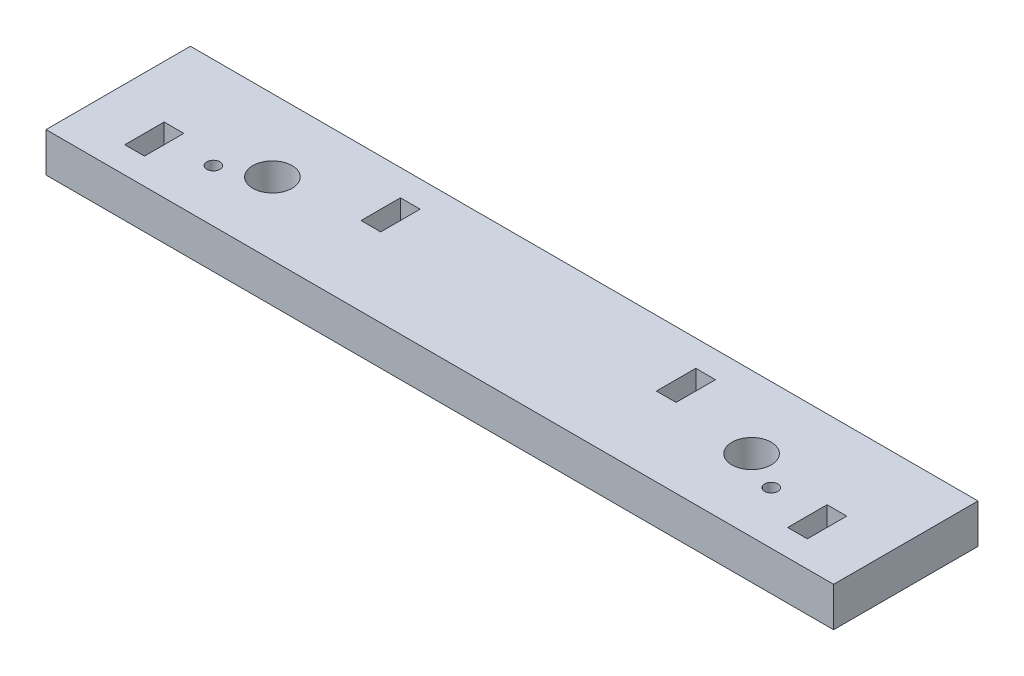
ISO-10303-21;
HEADER;
FILE_DESCRIPTION(('STEP AP214'),'2;1');
FILE_NAME('part.step','',(''),(''),'','','');
FILE_SCHEMA(('AUTOMOTIVE_DESIGN { 1 0 10303 214 1 1 1 1 }'));
ENDSEC;
DATA;
#1=APPLICATION_CONTEXT('core data for automotive mechanical design processes');
#2=APPLICATION_PROTOCOL_DEFINITION('international standard','automotive_design',2000,#1);
#3=PRODUCT_CONTEXT('',#1,'mechanical');
#4=PRODUCT('Part','Part','',(#3));
#5=PRODUCT_RELATED_PRODUCT_CATEGORY('part','',(#4));
#6=PRODUCT_DEFINITION_FORMATION('','',#4);
#7=PRODUCT_DEFINITION_CONTEXT('part definition',#1,'design');
#8=PRODUCT_DEFINITION('design','',#6,#7);
#9=PRODUCT_DEFINITION_SHAPE('','',#8);
#10=(LENGTH_UNIT() NAMED_UNIT(*) SI_UNIT(.MILLI.,.METRE.));
#11=(NAMED_UNIT(*) PLANE_ANGLE_UNIT() SI_UNIT($,.RADIAN.));
#12=(NAMED_UNIT(*) SI_UNIT($,.STERADIAN.) SOLID_ANGLE_UNIT());
#13=UNCERTAINTY_MEASURE_WITH_UNIT(LENGTH_MEASURE(1.E-05),#10,'distance_accuracy_value','');
#14=(GEOMETRIC_REPRESENTATION_CONTEXT(3) GLOBAL_UNCERTAINTY_ASSIGNED_CONTEXT((#13)) GLOBAL_UNIT_ASSIGNED_CONTEXT((#10,
#11,#12)) REPRESENTATION_CONTEXT('',''));
#15=CARTESIAN_POINT('',(0.,0.,0.));
#16=DIRECTION('',(0.,0.,1.));
#17=DIRECTION('',(1.,0.,0.));
#18=AXIS2_PLACEMENT_3D('',#15,#16,#17);
#19=CARTESIAN_POINT('',(-110.929014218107,19.05,-31.75));
#20=DIRECTION('',(0.,0.,1.));
#21=DIRECTION('',(1.,0.,0.));
#22=AXIS2_PLACEMENT_3D('',#19,#20,#21);
#23=PLANE('',#22);
#24=DIRECTION('',(-1.,0.,0.));
#25=VECTOR('',#24,1.);
#26=CARTESIAN_POINT('',(-110.929014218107,0.,-31.75));
#27=LINE('',#26,#25);
#28=CARTESIAN_POINT('',(355.6,0.,-31.75));
#29=VERTEX_POINT('',#28);
#30=CARTESIAN_POINT('',(346.075,0.,-31.75));
#31=VERTEX_POINT('',#30);
#32=EDGE_CURVE('E267',#29,#31,#27,.T.);
#33=ORIENTED_EDGE('',*,*,#32,.F.);
#34=DIRECTION('',(0.,-1.,0.));
#35=VECTOR('',#34,1.);
#36=CARTESIAN_POINT('',(355.6,19.05,-31.75));
#37=LINE('',#36,#35);
#38=CARTESIAN_POINT('',(355.6,19.05,-31.75));
#39=VERTEX_POINT('',#38);
#40=EDGE_CURVE('E11',#39,#29,#37,.T.);
#41=ORIENTED_EDGE('',*,*,#40,.F.);
#42=DIRECTION('',(-1.,0.,0.));
#43=VECTOR('',#42,1.);
#44=CARTESIAN_POINT('',(-110.929014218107,19.05,-31.75));
#45=LINE('',#44,#43);
#46=CARTESIAN_POINT('',(346.075,19.05,-31.75));
#47=VERTEX_POINT('',#46);
#48=EDGE_CURVE('E199',#39,#47,#45,.T.);
#49=ORIENTED_EDGE('',*,*,#48,.T.);
#50=DIRECTION('',(0.,-1.,0.));
#51=VECTOR('',#50,1.);
#52=CARTESIAN_POINT('',(346.075,19.05,-31.75));
#53=LINE('',#52,#51);
#54=EDGE_CURVE('E125',#47,#31,#53,.T.);
#55=ORIENTED_EDGE('',*,*,#54,.T.);
#56=EDGE_LOOP('',(#33,#41,#49,#55));
#57=FACE_BOUND('',#56,.T.);
#58=ADVANCED_FACE('F35',(#57),#23,.T.);
#59=CARTESIAN_POINT('',(355.6,19.05,-34.925));
#60=DIRECTION('',(-1.,0.,0.));
#61=DIRECTION('',(0.,0.,1.));
#62=AXIS2_PLACEMENT_3D('',#59,#60,#61);
#63=PLANE('',#62);
#64=DIRECTION('',(0.,0.,-1.));
#65=VECTOR('',#64,1.);
#66=CARTESIAN_POINT('',(355.6,0.,-34.925));
#67=LINE('',#66,#65);
#68=CARTESIAN_POINT('',(355.6,0.,-12.7));
#69=VERTEX_POINT('',#68);
#70=EDGE_CURVE('E189',#69,#29,#67,.T.);
#71=ORIENTED_EDGE('',*,*,#70,.F.);
#72=DIRECTION('',(0.,-1.,0.));
#73=VECTOR('',#72,1.);
#74=CARTESIAN_POINT('',(355.6,19.05,-12.7));
#75=LINE('',#74,#73);
#76=CARTESIAN_POINT('',(355.6,19.05,-12.7));
#77=VERTEX_POINT('',#76);
#78=EDGE_CURVE('E45',#77,#69,#75,.T.);
#79=ORIENTED_EDGE('',*,*,#78,.F.);
#80=DIRECTION('',(0.,0.,-1.));
#81=VECTOR('',#80,1.);
#82=CARTESIAN_POINT('',(355.6,19.05,-34.925));
#83=LINE('',#82,#81);
#84=EDGE_CURVE('E187',#77,#39,#83,.T.);
#85=ORIENTED_EDGE('',*,*,#84,.T.);
#86=ORIENTED_EDGE('',*,*,#40,.T.);
#87=EDGE_LOOP('',(#71,#79,#85,#86));
#88=FACE_BOUND('',#87,.T.);
#89=ADVANCED_FACE('F185',(#88),#63,.T.);
#90=CARTESIAN_POINT('',(-110.929014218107,19.05,-12.7));
#91=DIRECTION('',(0.,0.,1.));
#92=DIRECTION('',(1.,0.,0.));
#93=AXIS2_PLACEMENT_3D('',#90,#91,#92);
#94=PLANE('',#93);
#95=DIRECTION('',(-1.,0.,0.));
#96=VECTOR('',#95,1.);
#97=CARTESIAN_POINT('',(-110.929014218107,0.,-12.7));
#98=LINE('',#97,#96);
#99=CARTESIAN_POINT('',(346.075,0.,-12.7));
#100=VERTEX_POINT('',#99);
#101=EDGE_CURVE('E270',#69,#100,#98,.T.);
#102=ORIENTED_EDGE('',*,*,#101,.T.);
#103=DIRECTION('',(0.,-1.,0.));
#104=VECTOR('',#103,1.);
#105=CARTESIAN_POINT('',(346.075,19.05,-12.7));
#106=LINE('',#105,#104);
#107=CARTESIAN_POINT('',(346.075,19.05,-12.7));
#108=VERTEX_POINT('',#107);
#109=EDGE_CURVE('E192',#108,#100,#106,.T.);
#110=ORIENTED_EDGE('',*,*,#109,.F.);
#111=DIRECTION('',(-1.,0.,0.));
#112=VECTOR('',#111,1.);
#113=CARTESIAN_POINT('',(-110.929014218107,19.05,-12.7));
#114=LINE('',#113,#112);
#115=EDGE_CURVE('E195',#77,#108,#114,.T.);
#116=ORIENTED_EDGE('',*,*,#115,.F.);
#117=ORIENTED_EDGE('',*,*,#78,.T.);
#118=EDGE_LOOP('',(#102,#110,#116,#117));
#119=FACE_BOUND('',#118,.T.);
#120=ADVANCED_FACE('F196',(#119),#94,.F.);
#121=CARTESIAN_POINT('',(266.7,19.05,-34.925));
#122=DIRECTION('',(1.,0.,0.));
#123=DIRECTION('',(0.,0.,-1.));
#124=AXIS2_PLACEMENT_3D('',#121,#122,#123);
#125=PLANE('',#124);
#126=DIRECTION('',(0.,0.,1.));
#127=VECTOR('',#126,1.);
#128=CARTESIAN_POINT('',(266.7,0.,-34.925));
#129=LINE('',#128,#127);
#130=CARTESIAN_POINT('',(266.7,0.,-57.15));
#131=VERTEX_POINT('',#130);
#132=CARTESIAN_POINT('',(266.7,0.,-38.1));
#133=VERTEX_POINT('',#132);
#134=EDGE_CURVE('E255',#131,#133,#129,.T.);
#135=ORIENTED_EDGE('',*,*,#134,.T.);
#136=DIRECTION('',(0.,-1.,0.));
#137=VECTOR('',#136,1.);
#138=CARTESIAN_POINT('',(266.7,19.05,-38.1));
#139=LINE('',#138,#137);
#140=CARTESIAN_POINT('',(266.7,19.05,-38.1));
#141=VERTEX_POINT('',#140);
#142=EDGE_CURVE('E275',#141,#133,#139,.T.);
#143=ORIENTED_EDGE('',*,*,#142,.F.);
#144=DIRECTION('',(0.,0.,1.));
#145=VECTOR('',#144,1.);
#146=CARTESIAN_POINT('',(266.7,19.05,-34.925));
#147=LINE('',#146,#145);
#148=CARTESIAN_POINT('',(266.7,19.05,-57.15));
#149=VERTEX_POINT('',#148);
#150=EDGE_CURVE('E617',#149,#141,#147,.T.);
#151=ORIENTED_EDGE('',*,*,#150,.F.);
#152=DIRECTION('',(0.,-1.,0.));
#153=VECTOR('',#152,1.);
#154=CARTESIAN_POINT('',(266.7,19.05,-57.15));
#155=LINE('',#154,#153);
#156=EDGE_CURVE('E277',#149,#131,#155,.T.);
#157=ORIENTED_EDGE('',*,*,#156,.T.);
#158=EDGE_LOOP('',(#135,#143,#151,#157));
#159=FACE_BOUND('',#158,.T.);
#160=ADVANCED_FACE('F356',(#159),#125,.F.);
#161=CARTESIAN_POINT('',(-110.929014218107,19.05,-38.1));
#162=DIRECTION('',(0.,0.,1.));
#163=DIRECTION('',(1.,0.,0.));
#164=AXIS2_PLACEMENT_3D('',#161,#162,#163);
#165=PLANE('',#164);
#166=DIRECTION('',(-1.,0.,0.));
#167=VECTOR('',#166,1.);
#168=CARTESIAN_POINT('',(-110.929014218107,0.,-38.1));
#169=LINE('',#168,#167);
#170=CARTESIAN_POINT('',(257.175,0.,-38.1));
#171=VERTEX_POINT('',#170);
#172=EDGE_CURVE('E258',#133,#171,#169,.T.);
#173=ORIENTED_EDGE('',*,*,#172,.T.);
#174=DIRECTION('',(0.,-1.,0.));
#175=VECTOR('',#174,1.);
#176=CARTESIAN_POINT('',(257.175,19.05,-38.1));
#177=LINE('',#176,#175);
#178=CARTESIAN_POINT('',(257.175,19.05,-38.1));
#179=VERTEX_POINT('',#178);
#180=EDGE_CURVE('E282',#179,#171,#177,.T.);
#181=ORIENTED_EDGE('',*,*,#180,.F.);
#182=DIRECTION('',(-1.,0.,0.));
#183=VECTOR('',#182,1.);
#184=CARTESIAN_POINT('',(-110.929014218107,19.05,-38.1));
#185=LINE('',#184,#183);
#186=EDGE_CURVE('E620',#141,#179,#185,.T.);
#187=ORIENTED_EDGE('',*,*,#186,.F.);
#188=ORIENTED_EDGE('',*,*,#142,.T.);
#189=EDGE_LOOP('',(#173,#181,#187,#188));
#190=FACE_BOUND('',#189,.T.);
#191=ADVANCED_FACE('F352',(#190),#165,.F.);
#192=CARTESIAN_POINT('',(257.175,19.05,-34.925));
#193=DIRECTION('',(1.,0.,0.));
#194=DIRECTION('',(0.,0.,-1.));
#195=AXIS2_PLACEMENT_3D('',#192,#193,#194);
#196=PLANE('',#195);
#197=DIRECTION('',(0.,0.,1.));
#198=VECTOR('',#197,1.);
#199=CARTESIAN_POINT('',(257.175,0.,-34.925));
#200=LINE('',#199,#198);
#201=CARTESIAN_POINT('',(257.175,0.,-57.15));
#202=VERTEX_POINT('',#201);
#203=EDGE_CURVE('E261',#202,#171,#200,.T.);
#204=ORIENTED_EDGE('',*,*,#203,.F.);
#205=DIRECTION('',(0.,-1.,0.));
#206=VECTOR('',#205,1.);
#207=CARTESIAN_POINT('',(257.175,19.05,-57.15));
#208=LINE('',#207,#206);
#209=CARTESIAN_POINT('',(257.175,19.05,-57.15));
#210=VERTEX_POINT('',#209);
#211=EDGE_CURVE('E279',#210,#202,#208,.T.);
#212=ORIENTED_EDGE('',*,*,#211,.F.);
#213=DIRECTION('',(0.,0.,1.));
#214=VECTOR('',#213,1.);
#215=CARTESIAN_POINT('',(257.175,19.05,-34.925));
#216=LINE('',#215,#214);
#217=EDGE_CURVE('E626',#210,#179,#216,.T.);
#218=ORIENTED_EDGE('',*,*,#217,.T.);
#219=ORIENTED_EDGE('',*,*,#180,.T.);
#220=EDGE_LOOP('',(#204,#212,#218,#219));
#221=FACE_BOUND('',#220,.T.);
#222=ADVANCED_FACE('F348',(#221),#196,.T.);
#223=CARTESIAN_POINT('',(-110.929014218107,19.05,-69.85));
#224=DIRECTION('',(0.,0.,-1.));
#225=DIRECTION('',(-1.,0.,0.));
#226=AXIS2_PLACEMENT_3D('',#223,#224,#225);
#227=PLANE('',#226);
#228=DIRECTION('',(1.,0.,0.));
#229=VECTOR('',#228,1.);
#230=CARTESIAN_POINT('',(-110.929014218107,0.,-69.85));
#231=LINE('',#230,#229);
#232=CARTESIAN_POINT('',(0.,0.,-69.85));
#233=VERTEX_POINT('',#232);
#234=CARTESIAN_POINT('',(381.,0.,-69.85));
#235=VERTEX_POINT('',#234);
#236=EDGE_CURVE('E237',#233,#235,#231,.T.);
#237=ORIENTED_EDGE('',*,*,#236,.F.);
#238=DIRECTION('',(0.,-1.,0.));
#239=VECTOR('',#238,1.);
#240=CARTESIAN_POINT('',(0.,19.05,-69.85));
#241=LINE('',#240,#239);
#242=CARTESIAN_POINT('',(0.,19.05,-69.85));
#243=VERTEX_POINT('',#242);
#244=EDGE_CURVE('E280',#243,#233,#241,.T.);
#245=ORIENTED_EDGE('',*,*,#244,.F.);
#246=DIRECTION('',(1.,0.,0.));
#247=VECTOR('',#246,1.);
#248=CARTESIAN_POINT('',(-110.929014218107,19.05,-69.85));
#249=LINE('',#248,#247);
#250=CARTESIAN_POINT('',(381.,19.05,-69.85));
#251=VERTEX_POINT('',#250);
#252=EDGE_CURVE('E604',#243,#251,#249,.T.);
#253=ORIENTED_EDGE('',*,*,#252,.T.);
#254=DIRECTION('',(0.,-1.,0.));
#255=VECTOR('',#254,1.);
#256=CARTESIAN_POINT('',(381.,19.05,-69.85));
#257=LINE('',#256,#255);
#258=EDGE_CURVE('E286',#251,#235,#257,.T.);
#259=ORIENTED_EDGE('',*,*,#258,.T.);
#260=EDGE_LOOP('',(#237,#245,#253,#259));
#261=FACE_BOUND('',#260,.T.);
#262=ADVANCED_FACE('F351',(#261),#227,.T.);
#263=CARTESIAN_POINT('',(0.,19.05,-34.925));
#264=DIRECTION('',(-1.,0.,0.));
#265=DIRECTION('',(0.,0.,1.));
#266=AXIS2_PLACEMENT_3D('',#263,#264,#265);
#267=PLANE('',#266);
#268=DIRECTION('',(0.,0.,-1.));
#269=VECTOR('',#268,1.);
#270=CARTESIAN_POINT('',(0.,0.,-34.925));
#271=LINE('',#270,#269);
#272=CARTESIAN_POINT('',(0.,0.,0.));
#273=VERTEX_POINT('',#272);
#274=EDGE_CURVE('E240',#273,#233,#271,.T.);
#275=ORIENTED_EDGE('',*,*,#274,.F.);
#276=DIRECTION('',(0.,-1.,0.));
#277=VECTOR('',#276,1.);
#278=CARTESIAN_POINT('',(0.,19.05,0.));
#279=LINE('',#278,#277);
#280=CARTESIAN_POINT('',(0.,19.05,0.));
#281=VERTEX_POINT('',#280);
#282=EDGE_CURVE('E292',#281,#273,#279,.T.);
#283=ORIENTED_EDGE('',*,*,#282,.F.);
#284=DIRECTION('',(0.,0.,-1.));
#285=VECTOR('',#284,1.);
#286=CARTESIAN_POINT('',(0.,19.05,-34.925));
#287=LINE('',#286,#285);
#288=EDGE_CURVE('E640',#281,#243,#287,.T.);
#289=ORIENTED_EDGE('',*,*,#288,.T.);
#290=ORIENTED_EDGE('',*,*,#244,.T.);
#291=EDGE_LOOP('',(#275,#283,#289,#290));
#292=FACE_BOUND('',#291,.T.);
#293=ADVANCED_FACE('F377',(#292),#267,.T.);
#294=CARTESIAN_POINT('',(-110.929014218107,19.05,0.));
#295=DIRECTION('',(0.,0.,-1.));
#296=DIRECTION('',(-1.,0.,0.));
#297=AXIS2_PLACEMENT_3D('',#294,#295,#296);
#298=PLANE('',#297);
#299=DIRECTION('',(1.,0.,0.));
#300=VECTOR('',#299,1.);
#301=CARTESIAN_POINT('',(-110.929014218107,0.,0.));
#302=LINE('',#301,#300);
#303=CARTESIAN_POINT('',(381.,0.,0.));
#304=VERTEX_POINT('',#303);
#305=EDGE_CURVE('E243',#273,#304,#302,.T.);
#306=ORIENTED_EDGE('',*,*,#305,.T.);
#307=DIRECTION('',(0.,-1.,0.));
#308=VECTOR('',#307,1.);
#309=CARTESIAN_POINT('',(381.,19.05,0.));
#310=LINE('',#309,#308);
#311=CARTESIAN_POINT('',(381.,19.05,0.));
#312=VERTEX_POINT('',#311);
#313=EDGE_CURVE('E288',#312,#304,#310,.T.);
#314=ORIENTED_EDGE('',*,*,#313,.F.);
#315=DIRECTION('',(1.,0.,0.));
#316=VECTOR('',#315,1.);
#317=CARTESIAN_POINT('',(-110.929014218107,19.05,0.));
#318=LINE('',#317,#316);
#319=EDGE_CURVE('E637',#281,#312,#318,.T.);
#320=ORIENTED_EDGE('',*,*,#319,.F.);
#321=ORIENTED_EDGE('',*,*,#282,.T.);
#322=EDGE_LOOP('',(#306,#314,#320,#321));
#323=FACE_BOUND('',#322,.T.);
#324=ADVANCED_FACE('F373',(#323),#298,.F.);
#325=CARTESIAN_POINT('',(-110.929014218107,19.05,-12.7));
#326=DIRECTION('',(0.,0.,-1.));
#327=DIRECTION('',(-1.,0.,0.));
#328=AXIS2_PLACEMENT_3D('',#325,#326,#327);
#329=PLANE('',#328);
#330=DIRECTION('',(1.,0.,0.));
#331=VECTOR('',#330,1.);
#332=CARTESIAN_POINT('',(-110.929014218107,0.,-12.7));
#333=LINE('',#332,#331);
#334=CARTESIAN_POINT('',(25.4,0.,-12.7));
#335=VERTEX_POINT('',#334);
#336=CARTESIAN_POINT('',(34.925,0.,-12.7));
#337=VERTEX_POINT('',#336);
#338=EDGE_CURVE('E225',#335,#337,#333,.T.);
#339=ORIENTED_EDGE('',*,*,#338,.F.);
#340=DIRECTION('',(0.,-1.,0.));
#341=VECTOR('',#340,1.);
#342=CARTESIAN_POINT('',(25.4,19.05,-12.7));
#343=LINE('',#342,#341);
#344=CARTESIAN_POINT('',(25.4,19.05,-12.7));
#345=VERTEX_POINT('',#344);
#346=EDGE_CURVE('E289',#345,#335,#343,.T.);
#347=ORIENTED_EDGE('',*,*,#346,.F.);
#348=DIRECTION('',(1.,0.,0.));
#349=VECTOR('',#348,1.);
#350=CARTESIAN_POINT('',(-110.929014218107,19.05,-12.7));
#351=LINE('',#350,#349);
#352=CARTESIAN_POINT('',(34.925,19.05,-12.7));
#353=VERTEX_POINT('',#352);
#354=EDGE_CURVE('E599',#345,#353,#351,.T.);
#355=ORIENTED_EDGE('',*,*,#354,.T.);
#356=DIRECTION('',(0.,-1.,0.));
#357=VECTOR('',#356,1.);
#358=CARTESIAN_POINT('',(34.925,19.05,-12.7));
#359=LINE('',#358,#357);
#360=EDGE_CURVE('E295',#353,#337,#359,.T.);
#361=ORIENTED_EDGE('',*,*,#360,.T.);
#362=EDGE_LOOP('',(#339,#347,#355,#361));
#363=FACE_BOUND('',#362,.T.);
#364=ADVANCED_FACE('F376',(#363),#329,.T.);
#365=CARTESIAN_POINT('',(25.4,19.05,-34.925));
#366=DIRECTION('',(-1.,0.,0.));
#367=DIRECTION('',(0.,0.,1.));
#368=AXIS2_PLACEMENT_3D('',#365,#366,#367);
#369=PLANE('',#368);
#370=DIRECTION('',(0.,0.,-1.));
#371=VECTOR('',#370,1.);
#372=CARTESIAN_POINT('',(25.4,0.,-34.925));
#373=LINE('',#372,#371);
#374=CARTESIAN_POINT('',(25.4,0.,-31.75));
#375=VERTEX_POINT('',#374);
#376=EDGE_CURVE('E228',#335,#375,#373,.T.);
#377=ORIENTED_EDGE('',*,*,#376,.T.);
#378=DIRECTION('',(0.,-1.,0.));
#379=VECTOR('',#378,1.);
#380=CARTESIAN_POINT('',(25.4,19.05,-31.75));
#381=LINE('',#380,#379);
#382=CARTESIAN_POINT('',(25.4,19.05,-31.75));
#383=VERTEX_POINT('',#382);
#384=EDGE_CURVE('E299',#383,#375,#381,.T.);
#385=ORIENTED_EDGE('',*,*,#384,.F.);
#386=DIRECTION('',(0.,0.,-1.));
#387=VECTOR('',#386,1.);
#388=CARTESIAN_POINT('',(25.4,19.05,-34.925));
#389=LINE('',#388,#387);
#390=EDGE_CURVE('E648',#345,#383,#389,.T.);
#391=ORIENTED_EDGE('',*,*,#390,.F.);
#392=ORIENTED_EDGE('',*,*,#346,.T.);
#393=EDGE_LOOP('',(#377,#385,#391,#392));
#394=FACE_BOUND('',#393,.T.);
#395=ADVANCED_FACE('F391',(#394),#369,.F.);
#396=CARTESIAN_POINT('',(-110.929014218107,19.05,-31.75));
#397=DIRECTION('',(0.,0.,-1.));
#398=DIRECTION('',(-1.,0.,0.));
#399=AXIS2_PLACEMENT_3D('',#396,#397,#398);
#400=PLANE('',#399);
#401=DIRECTION('',(1.,0.,0.));
#402=VECTOR('',#401,1.);
#403=CARTESIAN_POINT('',(-110.929014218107,0.,-31.75));
#404=LINE('',#403,#402);
#405=CARTESIAN_POINT('',(34.925,0.,-31.75));
#406=VERTEX_POINT('',#405);
#407=EDGE_CURVE('E231',#375,#406,#404,.T.);
#408=ORIENTED_EDGE('',*,*,#407,.T.);
#409=DIRECTION('',(0.,-1.,0.));
#410=VECTOR('',#409,1.);
#411=CARTESIAN_POINT('',(34.925,19.05,-31.75));
#412=LINE('',#411,#410);
#413=CARTESIAN_POINT('',(34.925,19.05,-31.75));
#414=VERTEX_POINT('',#413);
#415=EDGE_CURVE('E297',#414,#406,#412,.T.);
#416=ORIENTED_EDGE('',*,*,#415,.F.);
#417=DIRECTION('',(1.,0.,0.));
#418=VECTOR('',#417,1.);
#419=CARTESIAN_POINT('',(-110.929014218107,19.05,-31.75));
#420=LINE('',#419,#418);
#421=EDGE_CURVE('E646',#383,#414,#420,.T.);
#422=ORIENTED_EDGE('',*,*,#421,.F.);
#423=ORIENTED_EDGE('',*,*,#384,.T.);
#424=EDGE_LOOP('',(#408,#416,#422,#423));
#425=FACE_BOUND('',#424,.T.);
#426=ADVANCED_FACE('F388',(#425),#400,.F.);
#427=CARTESIAN_POINT('',(114.3,19.05,-34.925));
#428=DIRECTION('',(1.,0.,0.));
#429=DIRECTION('',(0.,0.,-1.));
#430=AXIS2_PLACEMENT_3D('',#427,#428,#429);
#431=PLANE('',#430);
#432=DIRECTION('',(0.,0.,1.));
#433=VECTOR('',#432,1.);
#434=CARTESIAN_POINT('',(114.3,0.,-34.925));
#435=LINE('',#434,#433);
#436=CARTESIAN_POINT('',(114.3,0.,-57.15));
#437=VERTEX_POINT('',#436);
#438=CARTESIAN_POINT('',(114.3,0.,-38.1));
#439=VERTEX_POINT('',#438);
#440=EDGE_CURVE('E213',#437,#439,#435,.T.);
#441=ORIENTED_EDGE('',*,*,#440,.F.);
#442=DIRECTION('',(0.,-1.,0.));
#443=VECTOR('',#442,1.);
#444=CARTESIAN_POINT('',(114.3,19.05,-57.15));
#445=LINE('',#444,#443);
#446=CARTESIAN_POINT('',(114.3,19.05,-57.15));
#447=VERTEX_POINT('',#446);
#448=EDGE_CURVE('E39',#447,#437,#445,.T.);
#449=ORIENTED_EDGE('',*,*,#448,.F.);
#450=DIRECTION('',(0.,0.,1.));
#451=VECTOR('',#450,1.);
#452=CARTESIAN_POINT('',(114.3,19.05,-34.925));
#453=LINE('',#452,#451);
#454=CARTESIAN_POINT('',(114.3,19.05,-38.1));
#455=VERTEX_POINT('',#454);
#456=EDGE_CURVE('E320',#447,#455,#453,.T.);
#457=ORIENTED_EDGE('',*,*,#456,.T.);
#458=DIRECTION('',(0.,-1.,0.));
#459=VECTOR('',#458,1.);
#460=CARTESIAN_POINT('',(114.3,19.05,-38.1));
#461=LINE('',#460,#459);
#462=EDGE_CURVE('E206',#455,#439,#461,.T.);
#463=ORIENTED_EDGE('',*,*,#462,.T.);
#464=EDGE_LOOP('',(#441,#449,#457,#463));
#465=FACE_BOUND('',#464,.T.);
#466=ADVANCED_FACE('F319',(#465),#431,.T.);
#467=CARTESIAN_POINT('',(-110.929014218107,19.05,-57.15));
#468=DIRECTION('',(0.,0.,-1.));
#469=DIRECTION('',(-1.,0.,0.));
#470=AXIS2_PLACEMENT_3D('',#467,#468,#469);
#471=PLANE('',#470);
#472=DIRECTION('',(1.,0.,0.));
#473=VECTOR('',#472,1.);
#474=CARTESIAN_POINT('',(-110.929014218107,0.,-57.15));
#475=LINE('',#474,#473);
#476=CARTESIAN_POINT('',(123.825,0.,-57.15));
#477=VERTEX_POINT('',#476);
#478=EDGE_CURVE('E216',#437,#477,#475,.T.);
#479=ORIENTED_EDGE('',*,*,#478,.T.);
#480=DIRECTION('',(0.,-1.,0.));
#481=VECTOR('',#480,1.);
#482=CARTESIAN_POINT('',(123.825,19.05,-57.15));
#483=LINE('',#482,#481);
#484=CARTESIAN_POINT('',(123.825,19.05,-57.15));
#485=VERTEX_POINT('',#484);
#486=EDGE_CURVE('E305',#485,#477,#483,.T.);
#487=ORIENTED_EDGE('',*,*,#486,.F.);
#488=DIRECTION('',(1.,0.,0.));
#489=VECTOR('',#488,1.);
#490=CARTESIAN_POINT('',(-110.929014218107,19.05,-57.15));
#491=LINE('',#490,#489);
#492=EDGE_CURVE('E313',#447,#485,#491,.T.);
#493=ORIENTED_EDGE('',*,*,#492,.F.);
#494=ORIENTED_EDGE('',*,*,#448,.T.);
#495=EDGE_LOOP('',(#479,#487,#493,#494));
#496=FACE_BOUND('',#495,.T.);
#497=ADVANCED_FACE('F311',(#496),#471,.F.);
#498=CARTESIAN_POINT('',(123.825,19.05,-34.925));
#499=DIRECTION('',(1.,0.,0.));
#500=DIRECTION('',(0.,0.,-1.));
#501=AXIS2_PLACEMENT_3D('',#498,#499,#500);
#502=PLANE('',#501);
#503=DIRECTION('',(0.,0.,1.));
#504=VECTOR('',#503,1.);
#505=CARTESIAN_POINT('',(123.825,0.,-34.925));
#506=LINE('',#505,#504);
#507=CARTESIAN_POINT('',(123.825,0.,-38.1));
#508=VERTEX_POINT('',#507);
#509=EDGE_CURVE('E219',#477,#508,#506,.T.);
#510=ORIENTED_EDGE('',*,*,#509,.T.);
#511=DIRECTION('',(0.,-1.,0.));
#512=VECTOR('',#511,1.);
#513=CARTESIAN_POINT('',(123.825,19.05,-38.1));
#514=LINE('',#513,#512);
#515=CARTESIAN_POINT('',(123.825,19.05,-38.1));
#516=VERTEX_POINT('',#515);
#517=EDGE_CURVE('E304',#516,#508,#514,.T.);
#518=ORIENTED_EDGE('',*,*,#517,.F.);
#519=DIRECTION('',(0.,0.,1.));
#520=VECTOR('',#519,1.);
#521=CARTESIAN_POINT('',(123.825,19.05,-34.925));
#522=LINE('',#521,#520);
#523=EDGE_CURVE('E652',#485,#516,#522,.T.);
#524=ORIENTED_EDGE('',*,*,#523,.F.);
#525=ORIENTED_EDGE('',*,*,#486,.T.);
#526=EDGE_LOOP('',(#510,#518,#524,#525));
#527=FACE_BOUND('',#526,.T.);
#528=ADVANCED_FACE('F327',(#527),#502,.F.);
#529=CARTESIAN_POINT('',(-110.929014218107,19.05,-57.15));
#530=DIRECTION('',(0.,0.,1.));
#531=DIRECTION('',(1.,0.,0.));
#532=AXIS2_PLACEMENT_3D('',#529,#530,#531);
#533=PLANE('',#532);
#534=DIRECTION('',(-1.,0.,0.));
#535=VECTOR('',#534,1.);
#536=CARTESIAN_POINT('',(-110.929014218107,0.,-57.15));
#537=LINE('',#536,#535);
#538=EDGE_CURVE('E264',#131,#202,#537,.T.);
#539=ORIENTED_EDGE('',*,*,#538,.F.);
#540=ORIENTED_EDGE('',*,*,#156,.F.);
#541=DIRECTION('',(-1.,0.,0.));
#542=VECTOR('',#541,1.);
#543=CARTESIAN_POINT('',(-110.929014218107,19.05,-57.15));
#544=LINE('',#543,#542);
#545=EDGE_CURVE('E201',#149,#210,#544,.T.);
#546=ORIENTED_EDGE('',*,*,#545,.T.);
#547=ORIENTED_EDGE('',*,*,#211,.T.);
#548=EDGE_LOOP('',(#539,#540,#546,#547));
#549=FACE_BOUND('',#548,.T.);
#550=ADVANCED_FACE('F329',(#549),#533,.T.);
#551=CARTESIAN_POINT('',(306.3875,19.05,-34.925));
#552=DIRECTION('',(0.,-1.,0.));
#553=DIRECTION('',(0.,0.,-1.));
#554=AXIS2_PLACEMENT_3D('',#551,#552,#553);
#555=CYLINDRICAL_SURFACE('',#554,9.52500000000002);
#556=CARTESIAN_POINT('',(306.3875,19.05,-34.925));
#557=DIRECTION('',(0.,1.,0.));
#558=DIRECTION('',(0.,0.,1.));
#559=AXIS2_PLACEMENT_3D('',#556,#557,#558);
#560=CIRCLE('',#559,9.52500000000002);
#561=CARTESIAN_POINT('',(306.3875,19.05,-44.45));
#562=VERTEX_POINT('',#561);
#563=EDGE_CURVE('E613',#562,#562,#560,.F.);
#564=CARTESIAN_POINT('',(306.3875,0.,-34.925));
#565=DIRECTION('',(0.,1.,0.));
#566=DIRECTION('',(0.,0.,1.));
#567=AXIS2_PLACEMENT_3D('',#564,#565,#566);
#568=CIRCLE('',#567,9.52500000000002);
#569=CARTESIAN_POINT('',(306.3875,0.,-44.45));
#570=VERTEX_POINT('',#569);
#571=EDGE_CURVE('E252',#570,#570,#568,.F.);
#572=CARTESIAN_POINT('',(306.3875,19.05,-44.45));
#573=CARTESIAN_POINT('',(306.3875,18.8515625,-44.45));
#574=CARTESIAN_POINT('',(306.3875,18.653125,-44.45));
#575=CARTESIAN_POINT('',(306.3875,18.25625,-44.45));
#576=CARTESIAN_POINT('',(306.3875,18.0578125,-44.45));
#577=CARTESIAN_POINT('',(306.3875,17.6609375,-44.45));
#578=CARTESIAN_POINT('',(306.3875,17.4625,-44.45));
#579=CARTESIAN_POINT('',(306.3875,17.065625,-44.45));
#580=CARTESIAN_POINT('',(306.3875,16.8671875,-44.45));
#581=CARTESIAN_POINT('',(306.3875,16.4703125,-44.45));
#582=CARTESIAN_POINT('',(306.3875,16.271875,-44.45));
#583=CARTESIAN_POINT('',(306.3875,15.875,-44.45));
#584=CARTESIAN_POINT('',(306.3875,15.6765625,-44.45));
#585=CARTESIAN_POINT('',(306.3875,15.2796875,-44.45));
#586=CARTESIAN_POINT('',(306.3875,15.08125,-44.45));
#587=CARTESIAN_POINT('',(306.3875,14.684375,-44.45));
#588=CARTESIAN_POINT('',(306.3875,14.4859375,-44.45));
#589=CARTESIAN_POINT('',(306.3875,14.0890625,-44.45));
#590=CARTESIAN_POINT('',(306.3875,13.890625,-44.45));
#591=CARTESIAN_POINT('',(306.3875,13.49375,-44.45));
#592=CARTESIAN_POINT('',(306.3875,13.2953125,-44.45));
#593=CARTESIAN_POINT('',(306.3875,12.8984375,-44.45));
#594=CARTESIAN_POINT('',(306.3875,12.7,-44.45));
#595=CARTESIAN_POINT('',(306.3875,12.303125,-44.45));
#596=CARTESIAN_POINT('',(306.3875,12.1046875,-44.45));
#597=CARTESIAN_POINT('',(306.3875,11.7078125,-44.45));
#598=CARTESIAN_POINT('',(306.3875,11.509375,-44.45));
#599=CARTESIAN_POINT('',(306.3875,11.1125,-44.45));
#600=CARTESIAN_POINT('',(306.3875,10.9140625,-44.45));
#601=CARTESIAN_POINT('',(306.3875,10.5171875,-44.45));
#602=CARTESIAN_POINT('',(306.3875,10.31875,-44.45));
#603=CARTESIAN_POINT('',(306.3875,9.921875,-44.45));
#604=CARTESIAN_POINT('',(306.3875,9.7234375,-44.45));
#605=CARTESIAN_POINT('',(306.3875,9.3265625,-44.45));
#606=CARTESIAN_POINT('',(306.3875,9.128125,-44.45));
#607=CARTESIAN_POINT('',(306.3875,8.73125,-44.45));
#608=CARTESIAN_POINT('',(306.3875,8.5328125,-44.45));
#609=CARTESIAN_POINT('',(306.3875,8.1359375,-44.45));
#610=CARTESIAN_POINT('',(306.3875,7.9375,-44.45));
#611=CARTESIAN_POINT('',(306.3875,7.540625,-44.45));
#612=CARTESIAN_POINT('',(306.3875,7.3421875,-44.45));
#613=CARTESIAN_POINT('',(306.3875,6.9453125,-44.45));
#614=CARTESIAN_POINT('',(306.3875,6.746875,-44.45));
#615=CARTESIAN_POINT('',(306.3875,6.35,-44.45));
#616=CARTESIAN_POINT('',(306.3875,6.1515625,-44.45));
#617=CARTESIAN_POINT('',(306.3875,5.7546875,-44.45));
#618=CARTESIAN_POINT('',(306.3875,5.55625,-44.45));
#619=CARTESIAN_POINT('',(306.3875,5.159375,-44.45));
#620=CARTESIAN_POINT('',(306.3875,4.9609375,-44.45));
#621=CARTESIAN_POINT('',(306.3875,4.5640625,-44.45));
#622=CARTESIAN_POINT('',(306.3875,4.365625,-44.45));
#623=CARTESIAN_POINT('',(306.3875,3.96875,-44.45));
#624=CARTESIAN_POINT('',(306.3875,3.7703125,-44.45));
#625=CARTESIAN_POINT('',(306.3875,3.3734375,-44.45));
#626=CARTESIAN_POINT('',(306.3875,3.175,-44.45));
#627=CARTESIAN_POINT('',(306.3875,2.778125,-44.45));
#628=CARTESIAN_POINT('',(306.3875,2.5796875,-44.45));
#629=CARTESIAN_POINT('',(306.3875,2.1828125,-44.45));
#630=CARTESIAN_POINT('',(306.3875,1.984375,-44.45));
#631=CARTESIAN_POINT('',(306.3875,1.5875,-44.45));
#632=CARTESIAN_POINT('',(306.3875,1.3890625,-44.45));
#633=CARTESIAN_POINT('',(306.3875,0.992187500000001,-44.45));
#634=CARTESIAN_POINT('',(306.3875,0.793750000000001,-44.45));
#635=CARTESIAN_POINT('',(306.3875,0.396875,-44.45));
#636=CARTESIAN_POINT('',(306.3875,0.1984375,-44.45));
#637=CARTESIAN_POINT('',(306.3875,0.,-44.45));
#638=B_SPLINE_CURVE_WITH_KNOTS('',3,(#572,#573,#574,#575,#576,#577,#578,#579,#580,#581,#582,
#583,#584,#585,#586,#587,#588,#589,#590,#591,#592,#593,#594,#595,#596,#597,#598,#599,#600,#601,
#602,#603,#604,#605,#606,#607,#608,#609,#610,#611,#612,#613,#614,#615,#616,#617,#618,#619,#620,
#621,#622,#623,#624,#625,#626,#627,#628,#629,#630,#631,#632,#633,#634,#635,#636,#637),
.UNSPECIFIED.,.F.,.F.,(4,2,2,2,2,2,2,2,2,2,2,2,2,2,2,2,2,2,2,2,2,2,2,2,2,2,2,2,2,2,2,2,4),(0.,
0.5953125,1.190625,1.7859375,2.38125,2.9765625,3.571875,4.1671875,4.7625,5.3578125,5.953125,
6.5484375,7.14375,7.7390625,8.334375,8.9296875,9.525,10.1203125,10.715625,11.3109375,11.90625,
12.5015625,13.096875,13.6921875,14.2875,14.8828125,15.478125,16.0734375,16.66875,17.2640625,
17.859375,18.4546875,19.05),.UNSPECIFIED.);
#639=EDGE_CURVE('BSEAM335',#562,#570,#638,.T.);
#640=ORIENTED_EDGE('',*,*,#563,.F.);
#641=ORIENTED_EDGE('',*,*,#571,.T.);
#642=ORIENTED_EDGE('',*,*,#639,.T.);
#643=ORIENTED_EDGE('',*,*,#639,.F.);
#644=EDGE_LOOP('',(#640,#642,#641,#643));
#645=FACE_BOUND('',#644,.T.);
#646=ADVANCED_FACE('F335',(#645),#555,.F.);
#647=CARTESIAN_POINT('',(325.4375,19.05,-25.4));
#648=DIRECTION('',(0.,-1.,0.));
#649=DIRECTION('',(0.,0.,-1.));
#650=AXIS2_PLACEMENT_3D('',#647,#648,#649);
#651=CYLINDRICAL_SURFACE('',#650,3.17499999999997);
#652=CARTESIAN_POINT('',(325.4375,19.05,-25.4));
#653=DIRECTION('',(0.,1.,0.));
#654=DIRECTION('',(0.,0.,1.));
#655=AXIS2_PLACEMENT_3D('',#652,#653,#654);
#656=CIRCLE('',#655,3.17499999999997);
#657=CARTESIAN_POINT('',(325.4375,19.05,-28.575));
#658=VERTEX_POINT('',#657);
#659=EDGE_CURVE('E609',#658,#658,#656,.F.);
#660=CARTESIAN_POINT('',(325.4375,0.,-25.4));
#661=DIRECTION('',(0.,1.,0.));
#662=DIRECTION('',(0.,0.,1.));
#663=AXIS2_PLACEMENT_3D('',#660,#661,#662);
#664=CIRCLE('',#663,3.17499999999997);
#665=CARTESIAN_POINT('',(325.4375,0.,-28.575));
#666=VERTEX_POINT('',#665);
#667=EDGE_CURVE('E249',#666,#666,#664,.F.);
#668=CARTESIAN_POINT('',(325.4375,19.05,-28.575));
#669=CARTESIAN_POINT('',(325.4375,18.8515625,-28.575));
#670=CARTESIAN_POINT('',(325.4375,18.653125,-28.575));
#671=CARTESIAN_POINT('',(325.4375,18.25625,-28.575));
#672=CARTESIAN_POINT('',(325.4375,18.0578125,-28.575));
#673=CARTESIAN_POINT('',(325.4375,17.6609375,-28.575));
#674=CARTESIAN_POINT('',(325.4375,17.4625,-28.575));
#675=CARTESIAN_POINT('',(325.4375,17.065625,-28.575));
#676=CARTESIAN_POINT('',(325.4375,16.8671875,-28.575));
#677=CARTESIAN_POINT('',(325.4375,16.4703125,-28.575));
#678=CARTESIAN_POINT('',(325.4375,16.271875,-28.575));
#679=CARTESIAN_POINT('',(325.4375,15.875,-28.575));
#680=CARTESIAN_POINT('',(325.4375,15.6765625,-28.575));
#681=CARTESIAN_POINT('',(325.4375,15.2796875,-28.575));
#682=CARTESIAN_POINT('',(325.4375,15.08125,-28.575));
#683=CARTESIAN_POINT('',(325.4375,14.684375,-28.575));
#684=CARTESIAN_POINT('',(325.4375,14.4859375,-28.575));
#685=CARTESIAN_POINT('',(325.4375,14.0890625,-28.575));
#686=CARTESIAN_POINT('',(325.4375,13.890625,-28.575));
#687=CARTESIAN_POINT('',(325.4375,13.49375,-28.575));
#688=CARTESIAN_POINT('',(325.4375,13.2953125,-28.575));
#689=CARTESIAN_POINT('',(325.4375,12.8984375,-28.575));
#690=CARTESIAN_POINT('',(325.4375,12.7,-28.575));
#691=CARTESIAN_POINT('',(325.4375,12.303125,-28.575));
#692=CARTESIAN_POINT('',(325.4375,12.1046875,-28.575));
#693=CARTESIAN_POINT('',(325.4375,11.7078125,-28.575));
#694=CARTESIAN_POINT('',(325.4375,11.509375,-28.575));
#695=CARTESIAN_POINT('',(325.4375,11.1125,-28.575));
#696=CARTESIAN_POINT('',(325.4375,10.9140625,-28.575));
#697=CARTESIAN_POINT('',(325.4375,10.5171875,-28.575));
#698=CARTESIAN_POINT('',(325.4375,10.31875,-28.575));
#699=CARTESIAN_POINT('',(325.4375,9.921875,-28.575));
#700=CARTESIAN_POINT('',(325.4375,9.7234375,-28.575));
#701=CARTESIAN_POINT('',(325.4375,9.3265625,-28.575));
#702=CARTESIAN_POINT('',(325.4375,9.128125,-28.575));
#703=CARTESIAN_POINT('',(325.4375,8.73125,-28.575));
#704=CARTESIAN_POINT('',(325.4375,8.5328125,-28.575));
#705=CARTESIAN_POINT('',(325.4375,8.1359375,-28.575));
#706=CARTESIAN_POINT('',(325.4375,7.9375,-28.575));
#707=CARTESIAN_POINT('',(325.4375,7.540625,-28.575));
#708=CARTESIAN_POINT('',(325.4375,7.3421875,-28.575));
#709=CARTESIAN_POINT('',(325.4375,6.9453125,-28.575));
#710=CARTESIAN_POINT('',(325.4375,6.746875,-28.575));
#711=CARTESIAN_POINT('',(325.4375,6.35,-28.575));
#712=CARTESIAN_POINT('',(325.4375,6.1515625,-28.575));
#713=CARTESIAN_POINT('',(325.4375,5.7546875,-28.575));
#714=CARTESIAN_POINT('',(325.4375,5.55625,-28.575));
#715=CARTESIAN_POINT('',(325.4375,5.159375,-28.575));
#716=CARTESIAN_POINT('',(325.4375,4.9609375,-28.575));
#717=CARTESIAN_POINT('',(325.4375,4.5640625,-28.575));
#718=CARTESIAN_POINT('',(325.4375,4.365625,-28.575));
#719=CARTESIAN_POINT('',(325.4375,3.96875,-28.575));
#720=CARTESIAN_POINT('',(325.4375,3.7703125,-28.575));
#721=CARTESIAN_POINT('',(325.4375,3.3734375,-28.575));
#722=CARTESIAN_POINT('',(325.4375,3.175,-28.575));
#723=CARTESIAN_POINT('',(325.4375,2.778125,-28.575));
#724=CARTESIAN_POINT('',(325.4375,2.5796875,-28.575));
#725=CARTESIAN_POINT('',(325.4375,2.1828125,-28.575));
#726=CARTESIAN_POINT('',(325.4375,1.984375,-28.575));
#727=CARTESIAN_POINT('',(325.4375,1.5875,-28.575));
#728=CARTESIAN_POINT('',(325.4375,1.3890625,-28.575));
#729=CARTESIAN_POINT('',(325.4375,0.992187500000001,-28.575));
#730=CARTESIAN_POINT('',(325.4375,0.793750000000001,-28.575));
#731=CARTESIAN_POINT('',(325.4375,0.396875,-28.575));
#732=CARTESIAN_POINT('',(325.4375,0.1984375,-28.575));
#733=CARTESIAN_POINT('',(325.4375,0.,-28.575));
#734=B_SPLINE_CURVE_WITH_KNOTS('',3,(#668,#669,#670,#671,#672,#673,#674,#675,#676,#677,#678,
#679,#680,#681,#682,#683,#684,#685,#686,#687,#688,#689,#690,#691,#692,#693,#694,#695,#696,#697,
#698,#699,#700,#701,#702,#703,#704,#705,#706,#707,#708,#709,#710,#711,#712,#713,#714,#715,#716,
#717,#718,#719,#720,#721,#722,#723,#724,#725,#726,#727,#728,#729,#730,#731,#732,#733),
.UNSPECIFIED.,.F.,.F.,(4,2,2,2,2,2,2,2,2,2,2,2,2,2,2,2,2,2,2,2,2,2,2,2,2,2,2,2,2,2,2,2,4),(0.,
0.595312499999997,1.190625,1.7859375,2.38125,2.9765625,3.571875,4.1671875,4.7625,5.3578125,
5.953125,6.5484375,7.14375,7.7390625,8.334375,8.9296875,9.525,10.1203125,10.715625,11.3109375,
11.90625,12.5015625,13.096875,13.6921875,14.2875,14.8828125,15.478125,16.0734375,16.66875,
17.2640625,17.859375,18.4546875,19.05),.UNSPECIFIED.);
#735=EDGE_CURVE('BSEAM363',#658,#666,#734,.T.);
#736=ORIENTED_EDGE('',*,*,#659,.F.);
#737=ORIENTED_EDGE('',*,*,#667,.T.);
#738=ORIENTED_EDGE('',*,*,#735,.T.);
#739=ORIENTED_EDGE('',*,*,#735,.F.);
#740=EDGE_LOOP('',(#736,#738,#737,#739));
#741=FACE_BOUND('',#740,.T.);
#742=ADVANCED_FACE('F363',(#741),#651,.F.);
#743=CARTESIAN_POINT('',(381.,19.05,-34.925));
#744=DIRECTION('',(-1.,0.,0.));
#745=DIRECTION('',(0.,0.,1.));
#746=AXIS2_PLACEMENT_3D('',#743,#744,#745);
#747=PLANE('',#746);
#748=DIRECTION('',(0.,0.,-1.));
#749=VECTOR('',#748,1.);
#750=CARTESIAN_POINT('',(381.,0.,-34.925));
#751=LINE('',#750,#749);
#752=EDGE_CURVE('E246',#304,#235,#751,.T.);
#753=ORIENTED_EDGE('',*,*,#752,.T.);
#754=ORIENTED_EDGE('',*,*,#258,.F.);
#755=DIRECTION('',(0.,0.,-1.));
#756=VECTOR('',#755,1.);
#757=CARTESIAN_POINT('',(381.,19.05,-34.925));
#758=LINE('',#757,#756);
#759=EDGE_CURVE('E635',#312,#251,#758,.T.);
#760=ORIENTED_EDGE('',*,*,#759,.F.);
#761=ORIENTED_EDGE('',*,*,#313,.T.);
#762=EDGE_LOOP('',(#753,#754,#760,#761));
#763=FACE_BOUND('',#762,.T.);
#764=ADVANCED_FACE('F367',(#763),#747,.F.);
#765=CARTESIAN_POINT('',(34.925,19.05,-34.925));
#766=DIRECTION('',(-1.,0.,0.));
#767=DIRECTION('',(0.,0.,1.));
#768=AXIS2_PLACEMENT_3D('',#765,#766,#767);
#769=PLANE('',#768);
#770=DIRECTION('',(0.,0.,-1.));
#771=VECTOR('',#770,1.);
#772=CARTESIAN_POINT('',(34.925,0.,-34.925));
#773=LINE('',#772,#771);
#774=EDGE_CURVE('E234',#337,#406,#773,.T.);
#775=ORIENTED_EDGE('',*,*,#774,.F.);
#776=ORIENTED_EDGE('',*,*,#360,.F.);
#777=DIRECTION('',(0.,0.,-1.));
#778=VECTOR('',#777,1.);
#779=CARTESIAN_POINT('',(34.925,19.05,-34.925));
#780=LINE('',#779,#778);
#781=EDGE_CURVE('E643',#353,#414,#780,.T.);
#782=ORIENTED_EDGE('',*,*,#781,.T.);
#783=ORIENTED_EDGE('',*,*,#415,.T.);
#784=EDGE_LOOP('',(#775,#776,#782,#783));
#785=FACE_BOUND('',#784,.T.);
#786=ADVANCED_FACE('F371',(#785),#769,.T.);
#787=CARTESIAN_POINT('',(-110.929014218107,19.05,-38.1));
#788=DIRECTION('',(0.,0.,-1.));
#789=DIRECTION('',(-1.,0.,0.));
#790=AXIS2_PLACEMENT_3D('',#787,#788,#789);
#791=PLANE('',#790);
#792=DIRECTION('',(1.,0.,0.));
#793=VECTOR('',#792,1.);
#794=CARTESIAN_POINT('',(-110.929014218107,0.,-38.1));
#795=LINE('',#794,#793);
#796=EDGE_CURVE('E222',#439,#508,#795,.T.);
#797=ORIENTED_EDGE('',*,*,#796,.F.);
#798=ORIENTED_EDGE('',*,*,#462,.F.);
#799=DIRECTION('',(1.,0.,0.));
#800=VECTOR('',#799,1.);
#801=CARTESIAN_POINT('',(-110.929014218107,19.05,-38.1));
#802=LINE('',#801,#800);
#803=EDGE_CURVE('E325',#455,#516,#802,.T.);
#804=ORIENTED_EDGE('',*,*,#803,.T.);
#805=ORIENTED_EDGE('',*,*,#517,.T.);
#806=EDGE_LOOP('',(#797,#798,#804,#805));
#807=FACE_BOUND('',#806,.T.);
#808=ADVANCED_FACE('F324',(#807),#791,.T.);
#809=CARTESIAN_POINT('',(74.6125,19.05,-34.925));
#810=DIRECTION('',(0.,-1.,0.));
#811=DIRECTION('',(0.,0.,-1.));
#812=AXIS2_PLACEMENT_3D('',#809,#810,#811);
#813=CYLINDRICAL_SURFACE('',#812,9.52500000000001);
#814=CARTESIAN_POINT('',(74.6125,19.05,-34.925));
#815=DIRECTION('',(0.,1.,0.));
#816=DIRECTION('',(0.,0.,1.));
#817=AXIS2_PLACEMENT_3D('',#814,#815,#816);
#818=CIRCLE('',#817,9.52500000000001);
#819=CARTESIAN_POINT('',(74.6125,19.05,-44.45));
#820=VERTEX_POINT('',#819);
#821=EDGE_CURVE('E592',#820,#820,#818,.T.);
#822=CARTESIAN_POINT('',(74.6125,0.,-34.925));
#823=DIRECTION('',(0.,1.,0.));
#824=DIRECTION('',(0.,0.,1.));
#825=AXIS2_PLACEMENT_3D('',#822,#823,#824);
#826=CIRCLE('',#825,9.52500000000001);
#827=CARTESIAN_POINT('',(74.6125,0.,-44.45));
#828=VERTEX_POINT('',#827);
#829=EDGE_CURVE('E210',#828,#828,#826,.T.);
#830=CARTESIAN_POINT('',(74.6125,19.05,-44.45));
#831=CARTESIAN_POINT('',(74.6125,18.8515625,-44.45));
#832=CARTESIAN_POINT('',(74.6125,18.653125,-44.45));
#833=CARTESIAN_POINT('',(74.6125,18.25625,-44.45));
#834=CARTESIAN_POINT('',(74.6125,18.0578125,-44.45));
#835=CARTESIAN_POINT('',(74.6125,17.6609375,-44.45));
#836=CARTESIAN_POINT('',(74.6125,17.4625,-44.45));
#837=CARTESIAN_POINT('',(74.6125,17.065625,-44.45));
#838=CARTESIAN_POINT('',(74.6125,16.8671875,-44.45));
#839=CARTESIAN_POINT('',(74.6125,16.4703125,-44.45));
#840=CARTESIAN_POINT('',(74.6125,16.271875,-44.45));
#841=CARTESIAN_POINT('',(74.6125,15.875,-44.45));
#842=CARTESIAN_POINT('',(74.6125,15.6765625,-44.45));
#843=CARTESIAN_POINT('',(74.6125,15.2796875,-44.45));
#844=CARTESIAN_POINT('',(74.6125,15.08125,-44.45));
#845=CARTESIAN_POINT('',(74.6125,14.684375,-44.45));
#846=CARTESIAN_POINT('',(74.6125,14.4859375,-44.45));
#847=CARTESIAN_POINT('',(74.6125,14.0890625,-44.45));
#848=CARTESIAN_POINT('',(74.6125,13.890625,-44.45));
#849=CARTESIAN_POINT('',(74.6125,13.49375,-44.45));
#850=CARTESIAN_POINT('',(74.6125,13.2953125,-44.45));
#851=CARTESIAN_POINT('',(74.6125,12.8984375,-44.45));
#852=CARTESIAN_POINT('',(74.6125,12.7,-44.45));
#853=CARTESIAN_POINT('',(74.6125,12.303125,-44.45));
#854=CARTESIAN_POINT('',(74.6125,12.1046875,-44.45));
#855=CARTESIAN_POINT('',(74.6125,11.7078125,-44.45));
#856=CARTESIAN_POINT('',(74.6125,11.509375,-44.45));
#857=CARTESIAN_POINT('',(74.6125,11.1125,-44.45));
#858=CARTESIAN_POINT('',(74.6125,10.9140625,-44.45));
#859=CARTESIAN_POINT('',(74.6125,10.5171875,-44.45));
#860=CARTESIAN_POINT('',(74.6125,10.31875,-44.45));
#861=CARTESIAN_POINT('',(74.6125,9.921875,-44.45));
#862=CARTESIAN_POINT('',(74.6125,9.7234375,-44.45));
#863=CARTESIAN_POINT('',(74.6125,9.3265625,-44.45));
#864=CARTESIAN_POINT('',(74.6125,9.128125,-44.45));
#865=CARTESIAN_POINT('',(74.6125,8.73125,-44.45));
#866=CARTESIAN_POINT('',(74.6125,8.5328125,-44.45));
#867=CARTESIAN_POINT('',(74.6125,8.1359375,-44.45));
#868=CARTESIAN_POINT('',(74.6125,7.9375,-44.45));
#869=CARTESIAN_POINT('',(74.6125,7.540625,-44.45));
#870=CARTESIAN_POINT('',(74.6125,7.3421875,-44.45));
#871=CARTESIAN_POINT('',(74.6125,6.9453125,-44.45));
#872=CARTESIAN_POINT('',(74.6125,6.746875,-44.45));
#873=CARTESIAN_POINT('',(74.6125,6.35,-44.45));
#874=CARTESIAN_POINT('',(74.6125,6.1515625,-44.45));
#875=CARTESIAN_POINT('',(74.6125,5.7546875,-44.45));
#876=CARTESIAN_POINT('',(74.6125,5.55625,-44.45));
#877=CARTESIAN_POINT('',(74.6125,5.159375,-44.45));
#878=CARTESIAN_POINT('',(74.6125,4.9609375,-44.45));
#879=CARTESIAN_POINT('',(74.6125,4.5640625,-44.45));
#880=CARTESIAN_POINT('',(74.6125,4.365625,-44.45));
#881=CARTESIAN_POINT('',(74.6125,3.96875,-44.45));
#882=CARTESIAN_POINT('',(74.6125,3.7703125,-44.45));
#883=CARTESIAN_POINT('',(74.6125,3.3734375,-44.45));
#884=CARTESIAN_POINT('',(74.6125,3.175,-44.45));
#885=CARTESIAN_POINT('',(74.6125,2.778125,-44.45));
#886=CARTESIAN_POINT('',(74.6125,2.5796875,-44.45));
#887=CARTESIAN_POINT('',(74.6125,2.1828125,-44.45));
#888=CARTESIAN_POINT('',(74.6125,1.984375,-44.45));
#889=CARTESIAN_POINT('',(74.6125,1.5875,-44.45));
#890=CARTESIAN_POINT('',(74.6125,1.3890625,-44.45));
#891=CARTESIAN_POINT('',(74.6125,0.992187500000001,-44.45));
#892=CARTESIAN_POINT('',(74.6125,0.793750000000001,-44.45));
#893=CARTESIAN_POINT('',(74.6125,0.396875,-44.45));
#894=CARTESIAN_POINT('',(74.6125,0.1984375,-44.45));
#895=CARTESIAN_POINT('',(74.6125,0.,-44.45));
#896=B_SPLINE_CURVE_WITH_KNOTS('',3,(#830,#831,#832,#833,#834,#835,#836,#837,#838,#839,#840,
#841,#842,#843,#844,#845,#846,#847,#848,#849,#850,#851,#852,#853,#854,#855,#856,#857,#858,#859,
#860,#861,#862,#863,#864,#865,#866,#867,#868,#869,#870,#871,#872,#873,#874,#875,#876,#877,#878,
#879,#880,#881,#882,#883,#884,#885,#886,#887,#888,#889,#890,#891,#892,#893,#894,#895),
.UNSPECIFIED.,.F.,.F.,(4,2,2,2,2,2,2,2,2,2,2,2,2,2,2,2,2,2,2,2,2,2,2,2,2,2,2,2,2,2,2,2,4),(0.,
0.5953125,1.190625,1.7859375,2.38125,2.9765625,3.571875,4.1671875,4.7625,5.3578125,5.953125,
6.5484375,7.14375,7.7390625,8.334375,8.9296875,9.525,10.1203125,10.715625,11.3109375,11.90625,
12.5015625,13.096875,13.6921875,14.2875,14.8828125,15.478125,16.0734375,16.66875,17.2640625,
17.859375,18.4546875,19.05),.UNSPECIFIED.);
#897=EDGE_CURVE('BSEAM399',#820,#828,#896,.T.);
#898=ORIENTED_EDGE('',*,*,#821,.T.);
#899=ORIENTED_EDGE('',*,*,#829,.F.);
#900=ORIENTED_EDGE('',*,*,#897,.T.);
#901=ORIENTED_EDGE('',*,*,#897,.F.);
#902=EDGE_LOOP('',(#898,#900,#899,#901));
#903=FACE_BOUND('',#902,.T.);
#904=ADVANCED_FACE('F399',(#903),#813,.F.);
#905=CARTESIAN_POINT('',(55.5625,19.05,-25.4));
#906=DIRECTION('',(0.,-1.,0.));
#907=DIRECTION('',(0.,0.,-1.));
#908=AXIS2_PLACEMENT_3D('',#905,#906,#907);
#909=CYLINDRICAL_SURFACE('',#908,3.175);
#910=CARTESIAN_POINT('',(55.5625,19.05,-25.4));
#911=DIRECTION('',(0.,1.,0.));
#912=DIRECTION('',(0.,0.,1.));
#913=AXIS2_PLACEMENT_3D('',#910,#911,#912);
#914=CIRCLE('',#913,3.175);
#915=CARTESIAN_POINT('',(55.5625,19.05,-28.575));
#916=VERTEX_POINT('',#915);
#917=EDGE_CURVE('E273',#916,#916,#914,.T.);
#918=CARTESIAN_POINT('',(55.5625,0.,-25.4));
#919=DIRECTION('',(0.,1.,0.));
#920=DIRECTION('',(0.,0.,1.));
#921=AXIS2_PLACEMENT_3D('',#918,#919,#920);
#922=CIRCLE('',#921,3.175);
#923=CARTESIAN_POINT('',(55.5625,0.,-28.575));
#924=VERTEX_POINT('',#923);
#925=EDGE_CURVE('E207',#924,#924,#922,.T.);
#926=CARTESIAN_POINT('',(55.5625,19.05,-28.575));
#927=CARTESIAN_POINT('',(55.5625,18.8515625,-28.575));
#928=CARTESIAN_POINT('',(55.5625,18.653125,-28.575));
#929=CARTESIAN_POINT('',(55.5625,18.25625,-28.575));
#930=CARTESIAN_POINT('',(55.5625,18.0578125,-28.575));
#931=CARTESIAN_POINT('',(55.5625,17.6609375,-28.575));
#932=CARTESIAN_POINT('',(55.5625,17.4625,-28.575));
#933=CARTESIAN_POINT('',(55.5625,17.065625,-28.575));
#934=CARTESIAN_POINT('',(55.5625,16.8671875,-28.575));
#935=CARTESIAN_POINT('',(55.5625,16.4703125,-28.575));
#936=CARTESIAN_POINT('',(55.5625,16.271875,-28.575));
#937=CARTESIAN_POINT('',(55.5625,15.875,-28.575));
#938=CARTESIAN_POINT('',(55.5625,15.6765625,-28.575));
#939=CARTESIAN_POINT('',(55.5625,15.2796875,-28.575));
#940=CARTESIAN_POINT('',(55.5625,15.08125,-28.575));
#941=CARTESIAN_POINT('',(55.5625,14.684375,-28.575));
#942=CARTESIAN_POINT('',(55.5625,14.4859375,-28.575));
#943=CARTESIAN_POINT('',(55.5625,14.0890625,-28.575));
#944=CARTESIAN_POINT('',(55.5625,13.890625,-28.575));
#945=CARTESIAN_POINT('',(55.5625,13.49375,-28.575));
#946=CARTESIAN_POINT('',(55.5625,13.2953125,-28.575));
#947=CARTESIAN_POINT('',(55.5625,12.8984375,-28.575));
#948=CARTESIAN_POINT('',(55.5625,12.7,-28.575));
#949=CARTESIAN_POINT('',(55.5625,12.303125,-28.575));
#950=CARTESIAN_POINT('',(55.5625,12.1046875,-28.575));
#951=CARTESIAN_POINT('',(55.5625,11.7078125,-28.575));
#952=CARTESIAN_POINT('',(55.5625,11.509375,-28.575));
#953=CARTESIAN_POINT('',(55.5625,11.1125,-28.575));
#954=CARTESIAN_POINT('',(55.5625,10.9140625,-28.575));
#955=CARTESIAN_POINT('',(55.5625,10.5171875,-28.575));
#956=CARTESIAN_POINT('',(55.5625,10.31875,-28.575));
#957=CARTESIAN_POINT('',(55.5625,9.921875,-28.575));
#958=CARTESIAN_POINT('',(55.5625,9.7234375,-28.575));
#959=CARTESIAN_POINT('',(55.5625,9.3265625,-28.575));
#960=CARTESIAN_POINT('',(55.5625,9.128125,-28.575));
#961=CARTESIAN_POINT('',(55.5625,8.73125,-28.575));
#962=CARTESIAN_POINT('',(55.5625,8.5328125,-28.575));
#963=CARTESIAN_POINT('',(55.5625,8.1359375,-28.575));
#964=CARTESIAN_POINT('',(55.5625,7.9375,-28.575));
#965=CARTESIAN_POINT('',(55.5625,7.540625,-28.575));
#966=CARTESIAN_POINT('',(55.5625,7.3421875,-28.575));
#967=CARTESIAN_POINT('',(55.5625,6.9453125,-28.575));
#968=CARTESIAN_POINT('',(55.5625,6.746875,-28.575));
#969=CARTESIAN_POINT('',(55.5625,6.35,-28.575));
#970=CARTESIAN_POINT('',(55.5625,6.1515625,-28.575));
#971=CARTESIAN_POINT('',(55.5625,5.7546875,-28.575));
#972=CARTESIAN_POINT('',(55.5625,5.55625,-28.575));
#973=CARTESIAN_POINT('',(55.5625,5.159375,-28.575));
#974=CARTESIAN_POINT('',(55.5625,4.9609375,-28.575));
#975=CARTESIAN_POINT('',(55.5625,4.5640625,-28.575));
#976=CARTESIAN_POINT('',(55.5625,4.365625,-28.575));
#977=CARTESIAN_POINT('',(55.5625,3.96875,-28.575));
#978=CARTESIAN_POINT('',(55.5625,3.7703125,-28.575));
#979=CARTESIAN_POINT('',(55.5625,3.3734375,-28.575));
#980=CARTESIAN_POINT('',(55.5625,3.175,-28.575));
#981=CARTESIAN_POINT('',(55.5625,2.778125,-28.575));
#982=CARTESIAN_POINT('',(55.5625,2.5796875,-28.575));
#983=CARTESIAN_POINT('',(55.5625,2.1828125,-28.575));
#984=CARTESIAN_POINT('',(55.5625,1.984375,-28.575));
#985=CARTESIAN_POINT('',(55.5625,1.5875,-28.575));
#986=CARTESIAN_POINT('',(55.5625,1.3890625,-28.575));
#987=CARTESIAN_POINT('',(55.5625,0.992187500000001,-28.575));
#988=CARTESIAN_POINT('',(55.5625,0.793750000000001,-28.575));
#989=CARTESIAN_POINT('',(55.5625,0.396875,-28.575));
#990=CARTESIAN_POINT('',(55.5625,0.1984375,-28.575));
#991=CARTESIAN_POINT('',(55.5625,0.,-28.575));
#992=B_SPLINE_CURVE_WITH_KNOTS('',3,(#926,#927,#928,#929,#930,#931,#932,#933,#934,#935,#936,
#937,#938,#939,#940,#941,#942,#943,#944,#945,#946,#947,#948,#949,#950,#951,#952,#953,#954,#955,
#956,#957,#958,#959,#960,#961,#962,#963,#964,#965,#966,#967,#968,#969,#970,#971,#972,#973,#974,
#975,#976,#977,#978,#979,#980,#981,#982,#983,#984,#985,#986,#987,#988,#989,#990,#991),
.UNSPECIFIED.,.F.,.F.,(4,2,2,2,2,2,2,2,2,2,2,2,2,2,2,2,2,2,2,2,2,2,2,2,2,2,2,2,2,2,2,2,4),(0.,
0.595312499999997,1.190625,1.7859375,2.38125,2.9765625,3.571875,4.1671875,4.7625,5.3578125,
5.953125,6.5484375,7.14375,7.7390625,8.334375,8.9296875,9.525,10.1203125,10.715625,11.3109375,
11.90625,12.5015625,13.096875,13.6921875,14.2875,14.8828125,15.478125,16.0734375,16.66875,
17.2640625,17.859375,18.4546875,19.05),.UNSPECIFIED.);
#993=EDGE_CURVE('BSEAM37',#916,#924,#992,.T.);
#994=ORIENTED_EDGE('',*,*,#917,.T.);
#995=ORIENTED_EDGE('',*,*,#925,.F.);
#996=ORIENTED_EDGE('',*,*,#993,.T.);
#997=ORIENTED_EDGE('',*,*,#993,.F.);
#998=EDGE_LOOP('',(#994,#996,#995,#997));
#999=FACE_BOUND('',#998,.T.);
#1000=ADVANCED_FACE('F37',(#999),#909,.F.);
#1001=CARTESIAN_POINT('',(346.075,19.05,-34.925));
#1002=DIRECTION('',(-1.,0.,0.));
#1003=DIRECTION('',(0.,0.,1.));
#1004=AXIS2_PLACEMENT_3D('',#1001,#1002,#1003);
#1005=PLANE('',#1004);
#1006=DIRECTION('',(0.,0.,-1.));
#1007=VECTOR('',#1006,1.);
#1008=CARTESIAN_POINT('',(346.075,0.,-34.925));
#1009=LINE('',#1008,#1007);
#1010=EDGE_CURVE('E118',#100,#31,#1009,.T.);
#1011=ORIENTED_EDGE('',*,*,#1010,.T.);
#1012=ORIENTED_EDGE('',*,*,#54,.F.);
#1013=DIRECTION('',(0.,0.,-1.));
#1014=VECTOR('',#1013,1.);
#1015=CARTESIAN_POINT('',(346.075,19.05,-34.925));
#1016=LINE('',#1015,#1014);
#1017=EDGE_CURVE('E54',#108,#47,#1016,.T.);
#1018=ORIENTED_EDGE('',*,*,#1017,.F.);
#1019=ORIENTED_EDGE('',*,*,#109,.T.);
#1020=EDGE_LOOP('',(#1011,#1012,#1018,#1019));
#1021=FACE_BOUND('',#1020,.T.);
#1022=ADVANCED_FACE('F407',(#1021),#1005,.F.);
#1023=CARTESIAN_POINT('',(-110.929014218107,19.05,-34.925));
#1024=DIRECTION('',(0.,1.,0.));
#1025=DIRECTION('',(0.,0.,1.));
#1026=AXIS2_PLACEMENT_3D('',#1023,#1024,#1025);
#1027=PLANE('',#1026);
#1028=ORIENTED_EDGE('',*,*,#917,.F.);
#1029=EDGE_LOOP('',(#1028));
#1030=FACE_BOUND('',#1029,.T.);
#1031=ORIENTED_EDGE('',*,*,#821,.F.);
#1032=EDGE_LOOP('',(#1031));
#1033=FACE_BOUND('',#1032,.T.);
#1034=ORIENTED_EDGE('',*,*,#456,.F.);
#1035=ORIENTED_EDGE('',*,*,#492,.T.);
#1036=ORIENTED_EDGE('',*,*,#523,.T.);
#1037=ORIENTED_EDGE('',*,*,#803,.F.);
#1038=EDGE_LOOP('',(#1034,#1035,#1036,#1037));
#1039=FACE_BOUND('',#1038,.T.);
#1040=ORIENTED_EDGE('',*,*,#354,.F.);
#1041=ORIENTED_EDGE('',*,*,#390,.T.);
#1042=ORIENTED_EDGE('',*,*,#421,.T.);
#1043=ORIENTED_EDGE('',*,*,#781,.F.);
#1044=EDGE_LOOP('',(#1040,#1041,#1042,#1043));
#1045=FACE_BOUND('',#1044,.T.);
#1046=ORIENTED_EDGE('',*,*,#252,.F.);
#1047=ORIENTED_EDGE('',*,*,#288,.F.);
#1048=ORIENTED_EDGE('',*,*,#319,.T.);
#1049=ORIENTED_EDGE('',*,*,#759,.T.);
#1050=EDGE_LOOP('',(#1046,#1047,#1048,#1049));
#1051=FACE_BOUND('',#1050,.T.);
#1052=ORIENTED_EDGE('',*,*,#659,.T.);
#1053=EDGE_LOOP('',(#1052));
#1054=FACE_BOUND('',#1053,.T.);
#1055=ORIENTED_EDGE('',*,*,#563,.T.);
#1056=EDGE_LOOP('',(#1055));
#1057=FACE_BOUND('',#1056,.T.);
#1058=ORIENTED_EDGE('',*,*,#150,.T.);
#1059=ORIENTED_EDGE('',*,*,#186,.T.);
#1060=ORIENTED_EDGE('',*,*,#217,.F.);
#1061=ORIENTED_EDGE('',*,*,#545,.F.);
#1062=EDGE_LOOP('',(#1058,#1059,#1060,#1061));
#1063=FACE_BOUND('',#1062,.T.);
#1064=ORIENTED_EDGE('',*,*,#48,.F.);
#1065=ORIENTED_EDGE('',*,*,#84,.F.);
#1066=ORIENTED_EDGE('',*,*,#115,.T.);
#1067=ORIENTED_EDGE('',*,*,#1017,.T.);
#1068=EDGE_LOOP('',(#1064,#1065,#1066,#1067));
#1069=FACE_BOUND('',#1068,.T.);
#1070=ADVANCED_FACE('F198',(#1030,#1033,#1039,#1045,#1051,#1054,#1057,#1063,#1069),#1027,.T.);
#1071=CARTESIAN_POINT('',(-110.929014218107,0.,-34.925));
#1072=DIRECTION('',(0.,1.,0.));
#1073=DIRECTION('',(0.,0.,1.));
#1074=AXIS2_PLACEMENT_3D('',#1071,#1072,#1073);
#1075=PLANE('',#1074);
#1076=ORIENTED_EDGE('',*,*,#925,.T.);
#1077=EDGE_LOOP('',(#1076));
#1078=FACE_BOUND('',#1077,.T.);
#1079=ORIENTED_EDGE('',*,*,#829,.T.);
#1080=EDGE_LOOP('',(#1079));
#1081=FACE_BOUND('',#1080,.T.);
#1082=ORIENTED_EDGE('',*,*,#440,.T.);
#1083=ORIENTED_EDGE('',*,*,#796,.T.);
#1084=ORIENTED_EDGE('',*,*,#509,.F.);
#1085=ORIENTED_EDGE('',*,*,#478,.F.);
#1086=EDGE_LOOP('',(#1082,#1083,#1084,#1085));
#1087=FACE_BOUND('',#1086,.T.);
#1088=ORIENTED_EDGE('',*,*,#338,.T.);
#1089=ORIENTED_EDGE('',*,*,#774,.T.);
#1090=ORIENTED_EDGE('',*,*,#407,.F.);
#1091=ORIENTED_EDGE('',*,*,#376,.F.);
#1092=EDGE_LOOP('',(#1088,#1089,#1090,#1091));
#1093=FACE_BOUND('',#1092,.T.);
#1094=ORIENTED_EDGE('',*,*,#236,.T.);
#1095=ORIENTED_EDGE('',*,*,#752,.F.);
#1096=ORIENTED_EDGE('',*,*,#305,.F.);
#1097=ORIENTED_EDGE('',*,*,#274,.T.);
#1098=EDGE_LOOP('',(#1094,#1095,#1096,#1097));
#1099=FACE_BOUND('',#1098,.T.);
#1100=ORIENTED_EDGE('',*,*,#667,.F.);
#1101=EDGE_LOOP('',(#1100));
#1102=FACE_BOUND('',#1101,.T.);
#1103=ORIENTED_EDGE('',*,*,#571,.F.);
#1104=EDGE_LOOP('',(#1103));
#1105=FACE_BOUND('',#1104,.T.);
#1106=ORIENTED_EDGE('',*,*,#134,.F.);
#1107=ORIENTED_EDGE('',*,*,#538,.T.);
#1108=ORIENTED_EDGE('',*,*,#203,.T.);
#1109=ORIENTED_EDGE('',*,*,#172,.F.);
#1110=EDGE_LOOP('',(#1106,#1107,#1108,#1109));
#1111=FACE_BOUND('',#1110,.T.);
#1112=ORIENTED_EDGE('',*,*,#32,.T.);
#1113=ORIENTED_EDGE('',*,*,#1010,.F.);
#1114=ORIENTED_EDGE('',*,*,#101,.F.);
#1115=ORIENTED_EDGE('',*,*,#70,.T.);
#1116=EDGE_LOOP('',(#1112,#1113,#1114,#1115));
#1117=FACE_BOUND('',#1116,.T.);
#1118=ADVANCED_FACE('F316',(#1078,#1081,#1087,#1093,#1099,#1102,#1105,#1111,#1117),#1075,.F.);
#1119=CLOSED_SHELL('',(#58,#89,#120,#160,#191,#222,#262,#293,#324,#364,#395,#426,#466,#497,#528,
#550,#646,#742,#764,#786,#808,#904,#1000,#1022,#1070,#1118));
#1120=MANIFOLD_SOLID_BREP('B2',#1119);
#1121=ADVANCED_BREP_SHAPE_REPRESENTATION('',(#18,#1120),#14);
#1122=SHAPE_DEFINITION_REPRESENTATION(#9,#1121);
ENDSEC;
END-ISO-10303-21;
